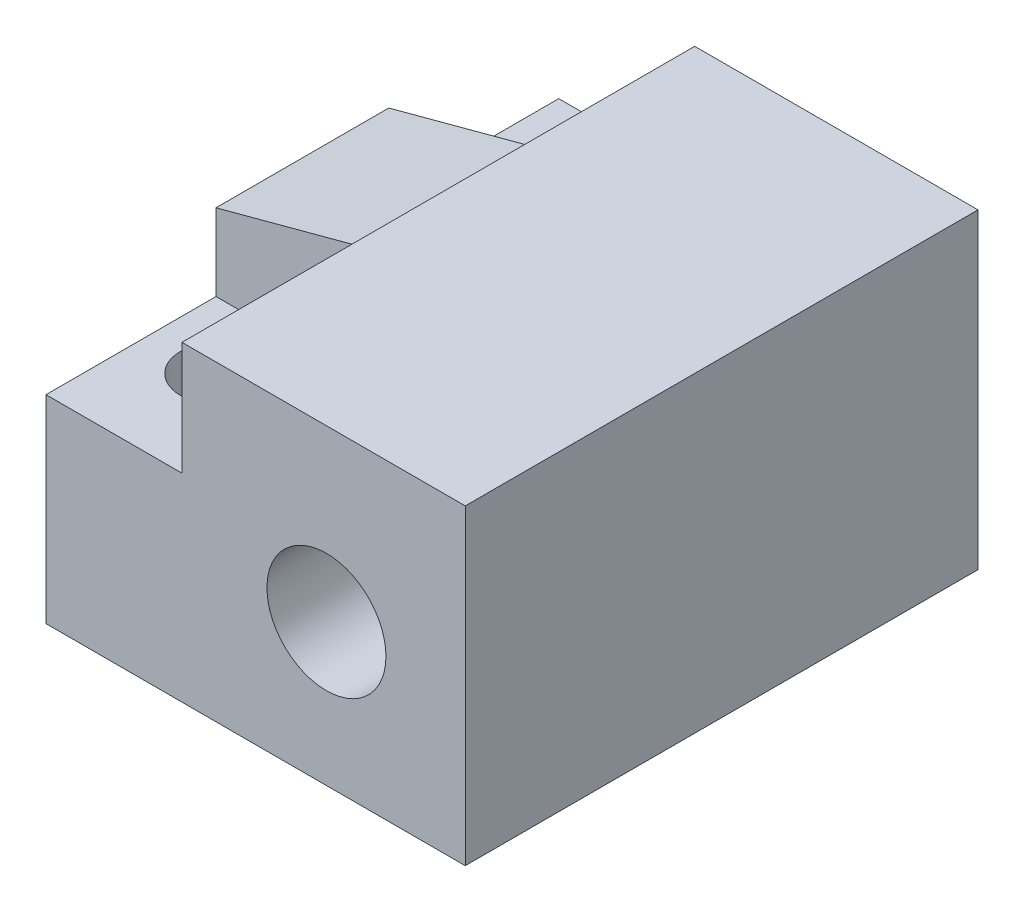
from build123d import *

# Parameters (mm, degrees)
MANIFOLD_BASE_DEPTH  = 18.1
P_PORT_R             = 2.1
P_PORTING_DEPTH      = 26.838924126
E_PORT_R             = 2.1
E_PORTING_DEPTH      = 6
SKETCH5_W            = 4.8
SKETCH5_H            = 6
CUT_EXTRUDE4_DEPTH   = 4
SKETCH6_R            = 1.35
MOUNTING_HOLES_DEPTH = 25.405941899


with BuildPart() as part:
    # Sketch1 → Manifold Base (new body)
    with BuildSketch(Plane.XY):
        Polygon((0, 0), (14.8, 0), (14.8, 11), (4.8, 11), (0, 9.713843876), align=None)
    extrude(amount=-MANIFOLD_BASE_DEPTH)

    # P Port → P porting (cut, through all)
    with BuildSketch(Plane.XY):
        with Locations((9.9, 5)):
            Circle(P_PORT_R)
    extrude(amount=-P_PORTING_DEPTH, mode=Mode.SUBTRACT)

    # E Port → E porting (cut)
    with BuildSketch(Plane.ZY):
        with Locations((-9.7, 5)):
            Circle(E_PORT_R)
    extrude(amount=-E_PORTING_DEPTH, mode=Mode.SUBTRACT)

    # Sketch5 → Cut-Extrude4 (cut)
    with BuildSketch(Plane(origin=(0, 7, 0), x_dir=(-1, 0, 0), z_dir=(0, 1, 0))):
        with Locations((-2.4, -3)):
            Rectangle(SKETCH5_W, SKETCH5_H)
        with Locations((-2.4, -15.1)):
            Rectangle(SKETCH5_W, SKETCH5_H)
    extrude(amount=CUT_EXTRUDE4_DEPTH, mode=Mode.SUBTRACT)

    # Sketch6 → Mounting holes (cut, through all)
    with BuildSketch(Plane(origin=(0, 7, 0), x_dir=(-1, 0, 0), z_dir=(0, 1, 0))):
        with Locations(Location((-2.4, -3.7, 0), (0, 0, 90))):
            Circle(SKETCH6_R)
        with Locations(Location((-2.4, -15.7, 0), (0, 0, 90))):
            Circle(SKETCH6_R)
    extrude(amount=-MOUNTING_HOLES_DEPTH, mode=Mode.SUBTRACT)


solid = part.part
